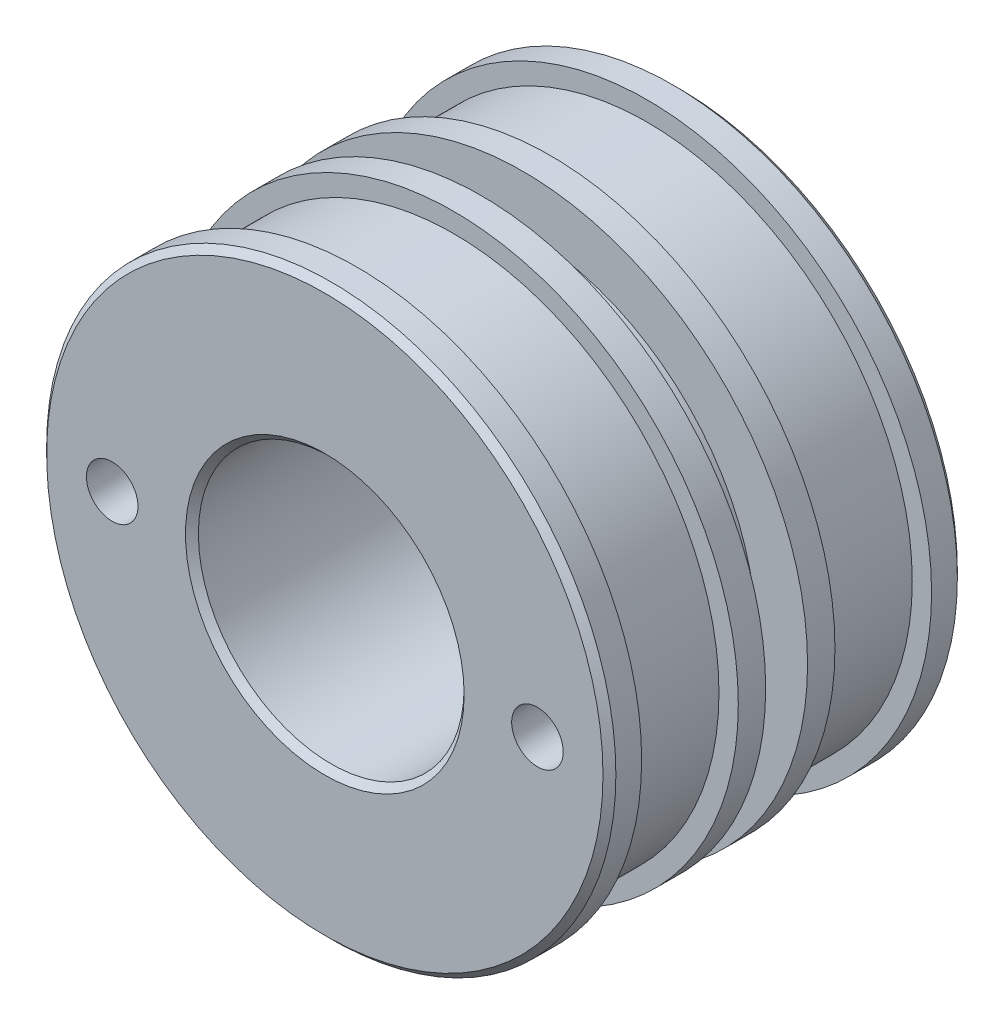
from build123d import *

# Parameters (mm, degrees)
SKETCH1_R           = 44.175
SKETCH1_R_2         = 20.625
BOSS_EXTRUDE1_DEPTH = 55
SKETCH2_W           = 15
SKETCH2_H           = 3
SKETCH2_W_2         = 6.5
SKETCH2_H_2         = 8
CHAMFER1_SIZE       = 1
SKETCH3_R           = 24.5
CUT_EXTRUDE1_DEPTH  = 15
CHAMFER2_SIZE       = 1
SKETCH4_R           = 4
CUT_EXTRUDE2_DEPTH  = 9


with BuildPart() as part:
    # Sketch1 → Boss-Extrude1 (new body)
    with BuildSketch(Plane.XY):
        Circle(SKETCH1_R)
        Circle(SKETCH1_R_2, mode=Mode.SUBTRACT)
    extrude(amount=-BOSS_EXTRUDE1_DEPTH)

    # Sketch2 → Cut-Revolve1 (revolve, cut)
    with BuildSketch(Plane(origin=(0, 0, 0), x_dir=(0, 0, -1), z_dir=(1, 0, 0)), mode=Mode.PRIVATE) as cut_revolve1_sk:
        with Locations((12.5, 42.675)):
            Rectangle(SKETCH2_W, SKETCH2_H)
        with Locations((27.5, 40.175)):
            Rectangle(SKETCH2_W_2, SKETCH2_H_2)
        with Locations((42.5, 42.675)):
            Rectangle(SKETCH2_W, SKETCH2_H)
    revolve(cut_revolve1_sk.sketch.rotate(Axis((0, 0, 0), (0, 0, -1)), 90), axis=Axis((0, 0, 0), (0, 0, -1)), mode=Mode.SUBTRACT)

    # Chamfer1
    chamfer1_edges = [part.edges().sort_by_distance(p)[0] for p in [
        (-44.175, 0, 0),
        (-44.175, 0, -55),
        (-20.625, 0, -55),
        (-20.625, 0, 0),
    ]]
    chamfer(chamfer1_edges, length=CHAMFER1_SIZE)

    # Sketch3 → Cut-Extrude1 (cut)
    with BuildSketch(Plane(origin=(0, 0, -55), x_dir=(-1, 0, 0), z_dir=(0, 0, -1))):
        Circle(SKETCH3_R)
    extrude(amount=-CUT_EXTRUDE1_DEPTH, mode=Mode.SUBTRACT)

    # Chamfer2
    chamfer2_edges = [part.edges().sort_by_distance(p)[0] for p in [
        (24.5, 0, -55),
    ]]
    chamfer(chamfer2_edges, length=CHAMFER2_SIZE)

    # Sketch4 → Cut-Extrude2 (cut)
    with BuildSketch(Plane.XY):
        with Locations((-33, 0)):
            Circle(SKETCH4_R)
        with Locations((33, 0)):
            Circle(SKETCH4_R)
    extrude(amount=-CUT_EXTRUDE2_DEPTH, mode=Mode.SUBTRACT)


solid = part.part
